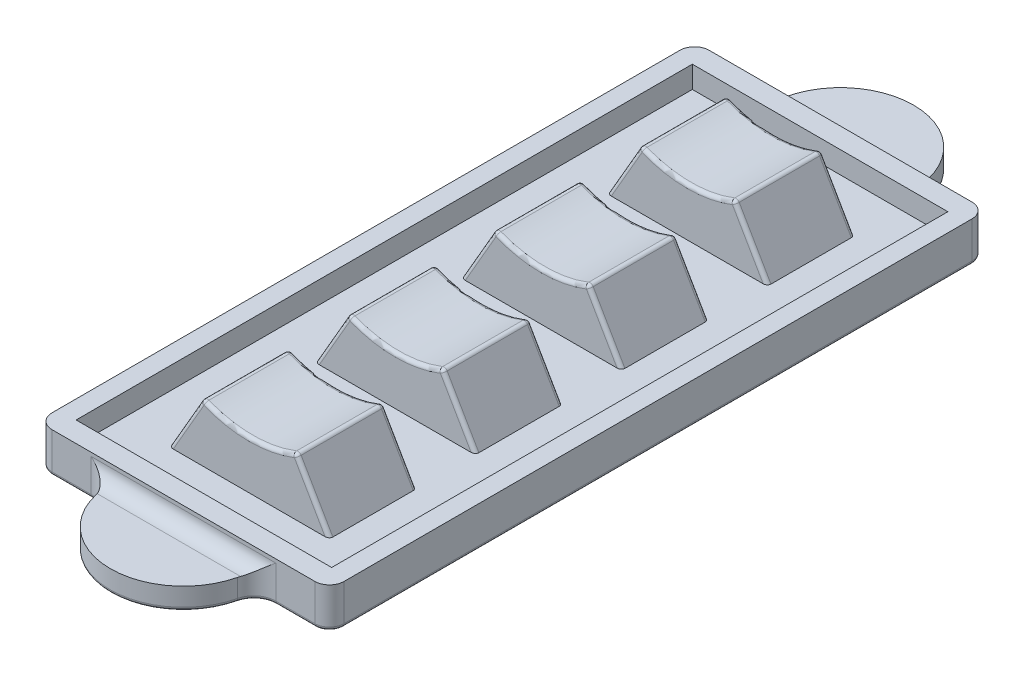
from build123d import *

# Parameters (mm, degrees)
BOSS_EXTRUDE1_DEPTH = 6
FILLET1_R           = 0.5
SKETCH3_W           = 40
SKETCH3_H           = 20
BOSS_EXTRUDE2_DEPTH = 2.5
LPATTERN1_COUNT     = 4
LPATTERN1_PITCH     = 20
SKETCH5_W           = 40
SKETCH5_H           = 90
BOSS_EXTRUDE3_DEPTH = 2.5
SKETCH6_W           = 40
SKETCH6_H           = 90
SKETCH6_W_2         = 35
SKETCH6_H_2         = 84.4
BOSS_EXTRUDE4_DEPTH = 3
BOSS_EXTRUDE5_DEPTH = 3
FILLET2_R           = 3
FILLET3_R           = 2
FILLET4_R           = 2
FILLET5_R           = 0.5


with BuildPart() as part:
    # Sketch2 → Boss-Extrude1 (new, symmetric)
    with BuildSketch(Plane.XY):
        with BuildLine():
            Line((-6.406745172, -15.096808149), (-10.969655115, -23))
            Line((-10.969655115, -23), (10.969655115, -23))
            Line((10.969655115, -23), (6.406745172, -15.096808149))
            ThreePointArc((6.406745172, -15.096808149), (0, -16.4), (-6.406745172, -15.096808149))
        make_face()
    extrude(amount=BOSS_EXTRUDE1_DEPTH, both=True)

    # Fillet1
    fillet1_edges = [part.edges().sort_by_distance(p)[0] for p in [
        (-8.688200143, -19.048404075, 6),
        (8.688200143, -19.048404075, 6),
        (8.688200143, -19.048404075, -6),
        (0, -16.4, 6),
        (-8.688200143, -19.048404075, -6),
        (0, -16.4, -6),
        (6.406745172, -15.096808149, 0),
        (-6.406745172, -15.096808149, 0),
    ]]
    fillet(fillet1_edges, radius=FILLET1_R)

    # Sketch3 → Boss-Extrude2 (add)
    with BuildSketch(Plane.XZ.offset(23)):
        Rectangle(SKETCH3_W, SKETCH3_H)
    extrude(amount=BOSS_EXTRUDE2_DEPTH)


with BuildPart() as lpattern1_1:
    # LPattern1: pattern copy
    add(part.part.moved(Location(Vector(0, 0, -1) * (1 * LPATTERN1_PITCH))))


with BuildPart() as lpattern1_2:
    # LPattern1: pattern copy
    add(part.part.moved(Location(Vector(0, 0, -1) * (2 * LPATTERN1_PITCH))))


with BuildPart() as lpattern1_3:
    # LPattern1: pattern copy
    add(part.part.moved(Location(Vector(0, 0, -1) * (3 * LPATTERN1_PITCH))))


with BuildPart() as part_1:
    add(part.part)

    # Combine1: union LPattern1_1, LPattern1_2, LPattern1_3
    add(lpattern1_1.part)
    add(lpattern1_2.part)
    add(lpattern1_3.part)

    # Sketch5 → Boss-Extrude3 (add)
    with BuildSketch(Plane.XZ.offset(25.5)):
        with Locations((0, -30)):
            Rectangle(SKETCH5_W, SKETCH5_H)
    extrude(amount=-BOSS_EXTRUDE3_DEPTH)

    # Sketch6 → Boss-Extrude4 (add)
    with BuildSketch(Plane(origin=(0, -23, 0), x_dir=(1, 0, 0), z_dir=(0, 1, 0))):
        with Locations((0, 30)):
            Rectangle(SKETCH6_W, SKETCH6_H)
        with Locations((0, 30)):
            Rectangle(SKETCH6_W_2, SKETCH6_H_2, mode=Mode.SUBTRACT)
    extrude(amount=BOSS_EXTRUDE4_DEPTH)

    # Sketch7 → Boss-Extrude5 (add)
    with BuildSketch(Plane.XZ.offset(25.5)):
        with BuildLine():
            ThreePointArc((-10, -75), (0, -85), (10, -75))
            Line((10, -75), (-10, -75))
        make_face()
        with BuildLine():
            Line((-10, 15), (10, 15))
            ThreePointArc((10, 15), (0, 25), (-10, 15))
        make_face()
    extrude(amount=-BOSS_EXTRUDE5_DEPTH)

    # Fillet2
    fillet2_edges = [part_1.edges().sort_by_distance(p)[0] for p in [
        (-10, -24, -75),
        (10, -24, -75),
        (10, -24, 15),
        (-10, -24, 15),
    ]]
    fillet(fillet2_edges, radius=FILLET2_R)

    # Fillet3
    fillet3_edges = [part_1.edges().sort_by_distance(p)[0] for p in [
        (0, -22.5, -75),
        (0, -22.5, 15),
    ]]
    fillet(fillet3_edges, radius=FILLET3_R)

    # Fillet4
    fillet4_edges = [part_1.edges().sort_by_distance(p)[0] for p in [
        (20, -22.75, 15),
        (-20, -22.75, -75),
        (20, -22.75, -75),
        (-20, -22.75, 15),
    ]]
    fillet(fillet4_edges, radius=FILLET4_R)

    # Fillet5
    fillet5_edges = [part_1.edges().sort_by_distance(p)[0] for p in [
        (0, -25.5, -85),
        (15.32455532, -25.5, -75),
        (-15.32455532, -25.5, 15),
        (0, -25.5, 25),
        (10.788589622, -25.5, -75.646606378),
        (-10.788589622, -25.5, -75.646606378),
        (10.788589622, -25.5, 15.646606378),
        (-10.788589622, -25.5, 15.646606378),
        (20, -25.5, -30),
        (15.32455532, -25.5, 15),
        (-20, -25.5, -30),
        (-15.32455532, -25.5, -75),
        (19.414213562, -25.5, -74.414213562),
        (-19.414213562, -25.5, -74.414213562),
        (-19.414213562, -25.5, 14.414213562),
        (19.414213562, -25.5, 14.414213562),
    ]]
    fillet(fillet5_edges, radius=FILLET5_R)


solid = part_1.part
